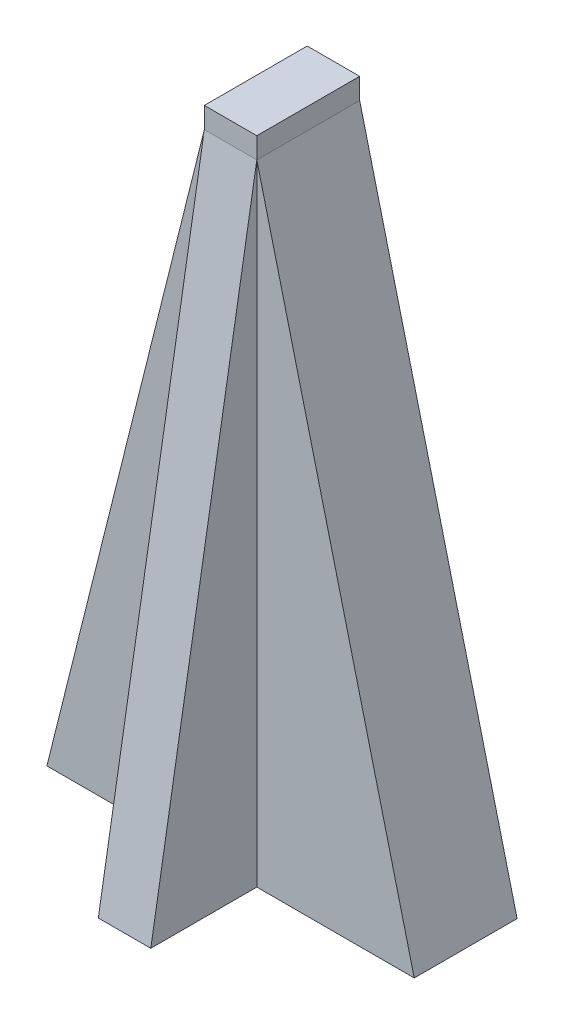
ISO-10303-21;
HEADER;
FILE_DESCRIPTION(('STEP AP214'),'2;1');
FILE_NAME('part.step','',(''),(''),'','','');
FILE_SCHEMA(('AUTOMOTIVE_DESIGN { 1 0 10303 214 1 1 1 1 }'));
ENDSEC;
DATA;
#1=APPLICATION_CONTEXT('core data for automotive mechanical design processes');
#2=APPLICATION_PROTOCOL_DEFINITION('international standard','automotive_design',2000,#1);
#3=PRODUCT_CONTEXT('',#1,'mechanical');
#4=PRODUCT('Part','Part','',(#3));
#5=PRODUCT_RELATED_PRODUCT_CATEGORY('part','',(#4));
#6=PRODUCT_DEFINITION_FORMATION('','',#4);
#7=PRODUCT_DEFINITION_CONTEXT('part definition',#1,'design');
#8=PRODUCT_DEFINITION('design','',#6,#7);
#9=PRODUCT_DEFINITION_SHAPE('','',#8);
#10=(LENGTH_UNIT() NAMED_UNIT(*) SI_UNIT(.MILLI.,.METRE.));
#11=(NAMED_UNIT(*) PLANE_ANGLE_UNIT() SI_UNIT($,.RADIAN.));
#12=(NAMED_UNIT(*) SI_UNIT($,.STERADIAN.) SOLID_ANGLE_UNIT());
#13=UNCERTAINTY_MEASURE_WITH_UNIT(LENGTH_MEASURE(1.E-05),#10,'distance_accuracy_value','');
#14=(GEOMETRIC_REPRESENTATION_CONTEXT(3) GLOBAL_UNCERTAINTY_ASSIGNED_CONTEXT((#13)) GLOBAL_UNIT_ASSIGNED_CONTEXT((#10,
#11,#12)) REPRESENTATION_CONTEXT('',''));
#15=CARTESIAN_POINT('',(0.,0.,0.));
#16=DIRECTION('',(0.,0.,1.));
#17=DIRECTION('',(1.,0.,0.));
#18=AXIS2_PLACEMENT_3D('',#15,#16,#17);
#19=CARTESIAN_POINT('',(6.35,-152.4,0.));
#20=DIRECTION('',(0.,1.,0.));
#21=DIRECTION('',(0.,0.,1.));
#22=AXIS2_PLACEMENT_3D('',#19,#20,#21);
#23=PLANE('',#22);
#24=DIRECTION('',(0.,0.,-1.));
#25=VECTOR('',#24,1.);
#26=CARTESIAN_POINT('',(-6.35,-152.4,0.));
#27=LINE('',#26,#25);
#28=CARTESIAN_POINT('',(-6.35,-152.4,38.1));
#29=VERTEX_POINT('',#28);
#30=CARTESIAN_POINT('',(-6.35,-152.4,12.446));
#31=VERTEX_POINT('',#30);
#32=EDGE_CURVE('E333',#29,#31,#27,.T.);
#33=ORIENTED_EDGE('',*,*,#32,.T.);
#34=DIRECTION('',(-1.,0.,0.));
#35=VECTOR('',#34,1.);
#36=CARTESIAN_POINT('',(-6.35,-152.4,12.446));
#37=LINE('',#36,#35);
#38=CARTESIAN_POINT('',(-44.45,-152.4,12.446));
#39=VERTEX_POINT('',#38);
#40=EDGE_CURVE('E67',#31,#39,#37,.T.);
#41=ORIENTED_EDGE('',*,*,#40,.T.);
#42=DIRECTION('',(0.,0.,-1.));
#43=VECTOR('',#42,1.);
#44=CARTESIAN_POINT('',(-44.45,-152.4,12.446));
#45=LINE('',#44,#43);
#46=CARTESIAN_POINT('',(-44.45,-152.4,-12.446));
#47=VERTEX_POINT('',#46);
#48=EDGE_CURVE('E280',#39,#47,#45,.T.);
#49=ORIENTED_EDGE('',*,*,#48,.T.);
#50=DIRECTION('',(-1.,0.,0.));
#51=VECTOR('',#50,1.);
#52=CARTESIAN_POINT('',(-6.35,-152.4,-12.446));
#53=LINE('',#52,#51);
#54=CARTESIAN_POINT('',(-6.35,-152.4,-12.446));
#55=VERTEX_POINT('',#54);
#56=EDGE_CURVE('E281',#55,#47,#53,.T.);
#57=ORIENTED_EDGE('',*,*,#56,.F.);
#58=CARTESIAN_POINT('',(-6.35,-152.4,-38.1));
#59=VERTEX_POINT('',#58);
#60=EDGE_CURVE('E332',#55,#59,#27,.T.);
#61=ORIENTED_EDGE('',*,*,#60,.T.);
#62=DIRECTION('',(-1.,0.,0.));
#63=VECTOR('',#62,1.);
#64=CARTESIAN_POINT('',(6.35,-152.4,-38.1));
#65=LINE('',#64,#63);
#66=CARTESIAN_POINT('',(6.35,-152.4,-38.1));
#67=VERTEX_POINT('',#66);
#68=EDGE_CURVE('E336',#67,#59,#65,.T.);
#69=ORIENTED_EDGE('',*,*,#68,.F.);
#70=DIRECTION('',(0.,0.,1.));
#71=VECTOR('',#70,1.);
#72=CARTESIAN_POINT('',(6.35,-152.4,0.));
#73=LINE('',#72,#71);
#74=CARTESIAN_POINT('',(6.35000000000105,-152.4,-12.446));
#75=VERTEX_POINT('',#74);
#76=EDGE_CURVE('E316',#67,#75,#73,.T.);
#77=ORIENTED_EDGE('',*,*,#76,.T.);
#78=DIRECTION('',(1.,0.,0.));
#79=VECTOR('',#78,1.);
#80=CARTESIAN_POINT('',(6.35000000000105,-152.4,-12.446));
#81=LINE('',#80,#79);
#82=CARTESIAN_POINT('',(44.450000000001,-152.4,-12.446));
#83=VERTEX_POINT('',#82);
#84=EDGE_CURVE('E285',#75,#83,#81,.T.);
#85=ORIENTED_EDGE('',*,*,#84,.T.);
#86=DIRECTION('',(0.,0.,-1.));
#87=VECTOR('',#86,1.);
#88=CARTESIAN_POINT('',(44.450000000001,-152.4,12.446));
#89=LINE('',#88,#87);
#90=CARTESIAN_POINT('',(44.450000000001,-152.4,12.446));
#91=VERTEX_POINT('',#90);
#92=EDGE_CURVE('E294',#91,#83,#89,.T.);
#93=ORIENTED_EDGE('',*,*,#92,.F.);
#94=DIRECTION('',(1.,0.,0.));
#95=VECTOR('',#94,1.);
#96=CARTESIAN_POINT('',(6.35000000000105,-152.4,12.446));
#97=LINE('',#96,#95);
#98=CARTESIAN_POINT('',(6.35000000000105,-152.4,12.446));
#99=VERTEX_POINT('',#98);
#100=EDGE_CURVE('E306',#99,#91,#97,.T.);
#101=ORIENTED_EDGE('',*,*,#100,.F.);
#102=CARTESIAN_POINT('',(6.35,-152.4,38.1));
#103=VERTEX_POINT('',#102);
#104=EDGE_CURVE('E320',#99,#103,#73,.T.);
#105=ORIENTED_EDGE('',*,*,#104,.T.);
#106=DIRECTION('',(-1.,0.,0.));
#107=VECTOR('',#106,1.);
#108=CARTESIAN_POINT('',(6.35,-152.4,38.1));
#109=LINE('',#108,#107);
#110=EDGE_CURVE('E326',#103,#29,#109,.T.);
#111=ORIENTED_EDGE('',*,*,#110,.T.);
#112=EDGE_LOOP('',(#33,#41,#49,#57,#61,#69,#77,#85,#93,#101,#105,#111));
#113=FACE_BOUND('',#112,.T.);
#114=DIRECTION('',(0.,0.,-1.));
#115=VECTOR('',#114,1.);
#116=CARTESIAN_POINT('',(-1.27,-152.4,0.));
#117=LINE('',#116,#115);
#118=CARTESIAN_POINT('',(-1.27,-152.4,32.9485290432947));
#119=VERTEX_POINT('',#118);
#120=CARTESIAN_POINT('',(-1.27,-152.4,7.366));
#121=VERTEX_POINT('',#120);
#122=EDGE_CURVE('E241',#119,#121,#117,.T.);
#123=ORIENTED_EDGE('',*,*,#122,.F.);
#124=DIRECTION('',(-1.,0.,0.));
#125=VECTOR('',#124,1.);
#126=CARTESIAN_POINT('',(6.35,-152.4,32.9485290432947));
#127=LINE('',#126,#125);
#128=CARTESIAN_POINT('',(1.27,-152.4,32.9485290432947));
#129=VERTEX_POINT('',#128);
#130=EDGE_CURVE('E221',#129,#119,#127,.T.);
#131=ORIENTED_EDGE('',*,*,#130,.F.);
#132=DIRECTION('',(0.,0.,1.));
#133=VECTOR('',#132,1.);
#134=CARTESIAN_POINT('',(1.27,-152.4,0.));
#135=LINE('',#134,#133);
#136=CARTESIAN_POINT('',(1.27,-152.4,7.366));
#137=VERTEX_POINT('',#136);
#138=EDGE_CURVE('E216',#137,#129,#135,.T.);
#139=ORIENTED_EDGE('',*,*,#138,.F.);
#140=DIRECTION('',(1.,0.,0.));
#141=VECTOR('',#140,1.);
#142=CARTESIAN_POINT('',(0.,-152.4,7.366));
#143=LINE('',#142,#141);
#144=CARTESIAN_POINT('',(39.2136558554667,-152.4,7.366));
#145=VERTEX_POINT('',#144);
#146=EDGE_CURVE('E232',#137,#145,#143,.T.);
#147=ORIENTED_EDGE('',*,*,#146,.T.);
#148=DIRECTION('',(0.,0.,-1.));
#149=VECTOR('',#148,1.);
#150=CARTESIAN_POINT('',(39.2136558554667,-152.4,12.446));
#151=LINE('',#150,#149);
#152=CARTESIAN_POINT('',(39.2136558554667,-152.4,-7.366));
#153=VERTEX_POINT('',#152);
#154=EDGE_CURVE('E268',#145,#153,#151,.T.);
#155=ORIENTED_EDGE('',*,*,#154,.T.);
#156=DIRECTION('',(1.,0.,0.));
#157=VECTOR('',#156,1.);
#158=CARTESIAN_POINT('',(0.,-152.4,-7.366));
#159=LINE('',#158,#157);
#160=CARTESIAN_POINT('',(1.27,-152.4,-7.366));
#161=VERTEX_POINT('',#160);
#162=EDGE_CURVE('E260',#161,#153,#159,.T.);
#163=ORIENTED_EDGE('',*,*,#162,.F.);
#164=DIRECTION('',(0.,0.,1.));
#165=VECTOR('',#164,1.);
#166=CARTESIAN_POINT('',(1.27,-152.4,0.));
#167=LINE('',#166,#165);
#168=CARTESIAN_POINT('',(1.27,-152.4,-32.9485290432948));
#169=VERTEX_POINT('',#168);
#170=EDGE_CURVE('E219',#169,#161,#167,.T.);
#171=ORIENTED_EDGE('',*,*,#170,.F.);
#172=DIRECTION('',(-1.,0.,0.));
#173=VECTOR('',#172,1.);
#174=CARTESIAN_POINT('',(6.35,-152.4,-32.9485290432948));
#175=LINE('',#174,#173);
#176=CARTESIAN_POINT('',(-1.27,-152.4,-32.9485290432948));
#177=VERTEX_POINT('',#176);
#178=EDGE_CURVE('E243',#169,#177,#175,.T.);
#179=ORIENTED_EDGE('',*,*,#178,.T.);
#180=DIRECTION('',(0.,0.,-1.));
#181=VECTOR('',#180,1.);
#182=CARTESIAN_POINT('',(-1.27,-152.4,0.));
#183=LINE('',#182,#181);
#184=CARTESIAN_POINT('',(-1.27,-152.4,-7.366));
#185=VERTEX_POINT('',#184);
#186=EDGE_CURVE('E246',#185,#177,#183,.T.);
#187=ORIENTED_EDGE('',*,*,#186,.F.);
#188=DIRECTION('',(-1.,0.,0.));
#189=VECTOR('',#188,1.);
#190=CARTESIAN_POINT('',(0.,-152.4,-7.366));
#191=LINE('',#190,#189);
#192=CARTESIAN_POINT('',(-39.2136558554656,-152.4,-7.366));
#193=VERTEX_POINT('',#192);
#194=EDGE_CURVE('E256',#185,#193,#191,.T.);
#195=ORIENTED_EDGE('',*,*,#194,.T.);
#196=DIRECTION('',(0.,0.,-1.));
#197=VECTOR('',#196,1.);
#198=CARTESIAN_POINT('',(-39.2136558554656,-152.4,12.446));
#199=LINE('',#198,#197);
#200=CARTESIAN_POINT('',(-39.2136558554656,-152.4,7.366));
#201=VERTEX_POINT('',#200);
#202=EDGE_CURVE('E252',#201,#193,#199,.T.);
#203=ORIENTED_EDGE('',*,*,#202,.F.);
#204=DIRECTION('',(-1.,0.,0.));
#205=VECTOR('',#204,1.);
#206=CARTESIAN_POINT('',(0.,-152.4,7.366));
#207=LINE('',#206,#205);
#208=EDGE_CURVE('E247',#121,#201,#207,.T.);
#209=ORIENTED_EDGE('',*,*,#208,.F.);
#210=EDGE_LOOP('',(#123,#131,#139,#147,#155,#163,#171,#179,#187,#195,#203,#209));
#211=FACE_BOUND('',#210,.T.);
#212=ADVANCED_FACE('F44',(#113,#211),#23,.F.);
#213=CARTESIAN_POINT('',(6.35,5.08,12.446));
#214=DIRECTION('',(-1.,0.,0.));
#215=DIRECTION('',(0.,0.,1.));
#216=AXIS2_PLACEMENT_3D('',#213,#214,#215);
#217=PLANE('',#216);
#218=DIRECTION('',(0.,-1.,0.));
#219=VECTOR('',#218,1.);
#220=CARTESIAN_POINT('',(6.35,0.,12.446));
#221=LINE('',#220,#219);
#222=CARTESIAN_POINT('',(6.35,0.,12.446));
#223=VERTEX_POINT('',#222);
#224=EDGE_CURVE('E301',#223,#99,#221,.T.);
#225=ORIENTED_EDGE('',*,*,#224,.F.);
#226=DIRECTION('',(0.,0.986126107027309,-0.16599789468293));
#227=VECTOR('',#226,1.);
#228=CARTESIAN_POINT('',(6.35,-152.4,38.1));
#229=LINE('',#228,#227);
#230=EDGE_CURVE('E319',#103,#223,#229,.T.);
#231=ORIENTED_EDGE('',*,*,#230,.F.);
#232=ORIENTED_EDGE('',*,*,#104,.F.);
#233=EDGE_LOOP('',(#225,#231,#232));
#234=FACE_BOUND('',#233,.T.);
#235=ADVANCED_FACE('F419',(#234),#217,.F.);
#236=DIRECTION('',(0.,0.986126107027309,0.16599789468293));
#237=VECTOR('',#236,1.);
#238=CARTESIAN_POINT('',(6.35,-152.4,-38.1));
#239=LINE('',#238,#237);
#240=CARTESIAN_POINT('',(6.35,0.,-12.446));
#241=VERTEX_POINT('',#240);
#242=EDGE_CURVE('E323',#67,#241,#239,.T.);
#243=ORIENTED_EDGE('',*,*,#242,.T.);
#244=DIRECTION('',(0.,-1.,0.));
#245=VECTOR('',#244,1.);
#246=CARTESIAN_POINT('',(6.35,0.,-12.446));
#247=LINE('',#246,#245);
#248=EDGE_CURVE('E302',#241,#75,#247,.T.);
#249=ORIENTED_EDGE('',*,*,#248,.T.);
#250=ORIENTED_EDGE('',*,*,#76,.F.);
#251=EDGE_LOOP('',(#243,#249,#250));
#252=FACE_BOUND('',#251,.T.);
#253=ADVANCED_FACE('F425',(#252),#217,.F.);
#254=CARTESIAN_POINT('',(-6.35,5.08,12.446));
#255=DIRECTION('',(1.,0.,0.));
#256=DIRECTION('',(0.,0.,-1.));
#257=AXIS2_PLACEMENT_3D('',#254,#255,#256);
#258=PLANE('',#257);
#259=DIRECTION('',(0.,-1.,0.));
#260=VECTOR('',#259,1.);
#261=CARTESIAN_POINT('',(-6.35,0.,-12.446));
#262=LINE('',#261,#260);
#263=CARTESIAN_POINT('',(-6.35,0.,-12.446));
#264=VERTEX_POINT('',#263);
#265=EDGE_CURVE('E276',#264,#55,#262,.T.);
#266=ORIENTED_EDGE('',*,*,#265,.F.);
#267=DIRECTION('',(0.,0.986126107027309,0.16599789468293));
#268=VECTOR('',#267,1.);
#269=CARTESIAN_POINT('',(-6.35,-152.4,-38.1));
#270=LINE('',#269,#268);
#271=EDGE_CURVE('E329',#59,#264,#270,.T.);
#272=ORIENTED_EDGE('',*,*,#271,.F.);
#273=ORIENTED_EDGE('',*,*,#60,.F.);
#274=EDGE_LOOP('',(#266,#272,#273));
#275=FACE_BOUND('',#274,.T.);
#276=ADVANCED_FACE('F381',(#275),#258,.F.);
#277=DIRECTION('',(0.,0.,-1.));
#278=VECTOR('',#277,1.);
#279=CARTESIAN_POINT('',(-6.35,0.,12.446));
#280=LINE('',#279,#278);
#281=CARTESIAN_POINT('',(-6.35,0.,12.446));
#282=VERTEX_POINT('',#281);
#283=EDGE_CURVE('E290',#282,#264,#280,.T.);
#284=ORIENTED_EDGE('',*,*,#283,.F.);
#285=DIRECTION('',(0.,-1.,0.));
#286=VECTOR('',#285,1.);
#287=CARTESIAN_POINT('',(-6.35,5.08,12.446));
#288=LINE('',#287,#286);
#289=CARTESIAN_POINT('',(-6.35,5.08,12.446));
#290=VERTEX_POINT('',#289);
#291=EDGE_CURVE('E359',#290,#282,#288,.T.);
#292=ORIENTED_EDGE('',*,*,#291,.F.);
#293=DIRECTION('',(0.,0.,1.));
#294=VECTOR('',#293,1.);
#295=CARTESIAN_POINT('',(-6.35,5.08,12.446));
#296=LINE('',#295,#294);
#297=CARTESIAN_POINT('',(-6.35,5.08,-12.446));
#298=VERTEX_POINT('',#297);
#299=EDGE_CURVE('E348',#298,#290,#296,.T.);
#300=ORIENTED_EDGE('',*,*,#299,.F.);
#301=DIRECTION('',(0.,-1.,0.));
#302=VECTOR('',#301,1.);
#303=CARTESIAN_POINT('',(-6.35,5.08,-12.446));
#304=LINE('',#303,#302);
#305=EDGE_CURVE('E52',#298,#264,#304,.T.);
#306=ORIENTED_EDGE('',*,*,#305,.T.);
#307=EDGE_LOOP('',(#284,#292,#300,#306));
#308=FACE_BOUND('',#307,.T.);
#309=ADVANCED_FACE('F366',(#308),#258,.F.);
#310=DIRECTION('',(0.,-1.,0.));
#311=VECTOR('',#310,1.);
#312=CARTESIAN_POINT('',(6.35,5.08,12.446));
#313=LINE('',#312,#311);
#314=CARTESIAN_POINT('',(6.35,5.08,12.446));
#315=VERTEX_POINT('',#314);
#316=EDGE_CURVE('E352',#315,#223,#313,.T.);
#317=ORIENTED_EDGE('',*,*,#316,.T.);
#318=DIRECTION('',(0.,0.,-1.));
#319=VECTOR('',#318,1.);
#320=CARTESIAN_POINT('',(6.35,0.,12.446));
#321=LINE('',#320,#319);
#322=EDGE_CURVE('E297',#223,#241,#321,.T.);
#323=ORIENTED_EDGE('',*,*,#322,.T.);
#324=DIRECTION('',(0.,-1.,0.));
#325=VECTOR('',#324,1.);
#326=CARTESIAN_POINT('',(6.35,5.08,-12.446));
#327=LINE('',#326,#325);
#328=CARTESIAN_POINT('',(6.35,5.08,-12.446));
#329=VERTEX_POINT('',#328);
#330=EDGE_CURVE('E11',#329,#241,#327,.T.);
#331=ORIENTED_EDGE('',*,*,#330,.F.);
#332=DIRECTION('',(0.,0.,-1.));
#333=VECTOR('',#332,1.);
#334=CARTESIAN_POINT('',(6.35,5.08,12.446));
#335=LINE('',#334,#333);
#336=EDGE_CURVE('E342',#315,#329,#335,.T.);
#337=ORIENTED_EDGE('',*,*,#336,.F.);
#338=EDGE_LOOP('',(#317,#323,#331,#337));
#339=FACE_BOUND('',#338,.T.);
#340=ADVANCED_FACE('F46',(#339),#217,.F.);
#341=CARTESIAN_POINT('',(-6.35,5.08,-12.446));
#342=DIRECTION('',(0.,0.,1.));
#343=DIRECTION('',(1.,0.,0.));
#344=AXIS2_PLACEMENT_3D('',#341,#342,#343);
#345=PLANE('',#344);
#346=DIRECTION('',(-1.,0.,0.));
#347=VECTOR('',#346,1.);
#348=CARTESIAN_POINT('',(-6.35,0.,-12.446));
#349=LINE('',#348,#347);
#350=EDGE_CURVE('E339',#241,#264,#349,.T.);
#351=ORIENTED_EDGE('',*,*,#350,.T.);
#352=ORIENTED_EDGE('',*,*,#305,.F.);
#353=DIRECTION('',(-1.,0.,0.));
#354=VECTOR('',#353,1.);
#355=CARTESIAN_POINT('',(-6.35,5.08,-12.446));
#356=LINE('',#355,#354);
#357=EDGE_CURVE('E345',#329,#298,#356,.T.);
#358=ORIENTED_EDGE('',*,*,#357,.F.);
#359=ORIENTED_EDGE('',*,*,#330,.T.);
#360=EDGE_LOOP('',(#351,#352,#358,#359));
#361=FACE_BOUND('',#360,.T.);
#362=ADVANCED_FACE('F370',(#361),#345,.F.);
#363=DIRECTION('',(0.,0.986126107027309,-0.16599789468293));
#364=VECTOR('',#363,1.);
#365=CARTESIAN_POINT('',(-6.35,-152.4,38.1));
#366=LINE('',#365,#364);
#367=EDGE_CURVE('E292',#29,#282,#366,.T.);
#368=ORIENTED_EDGE('',*,*,#367,.T.);
#369=DIRECTION('',(0.,-1.,0.));
#370=VECTOR('',#369,1.);
#371=CARTESIAN_POINT('',(-6.35,0.,12.446));
#372=LINE('',#371,#370);
#373=EDGE_CURVE('E278',#282,#31,#372,.T.);
#374=ORIENTED_EDGE('',*,*,#373,.T.);
#375=ORIENTED_EDGE('',*,*,#32,.F.);
#376=EDGE_LOOP('',(#368,#374,#375));
#377=FACE_BOUND('',#376,.T.);
#378=ADVANCED_FACE('F389',(#377),#258,.F.);
#379=CARTESIAN_POINT('',(-6.35,5.08,12.446));
#380=DIRECTION('',(0.,0.,-1.));
#381=DIRECTION('',(-1.,0.,0.));
#382=AXIS2_PLACEMENT_3D('',#379,#380,#381);
#383=PLANE('',#382);
#384=DIRECTION('',(1.,0.,0.));
#385=VECTOR('',#384,1.);
#386=CARTESIAN_POINT('',(-6.35,0.,12.446));
#387=LINE('',#386,#385);
#388=EDGE_CURVE('E346',#282,#223,#387,.T.);
#389=ORIENTED_EDGE('',*,*,#388,.T.);
#390=ORIENTED_EDGE('',*,*,#316,.F.);
#391=DIRECTION('',(1.,0.,0.));
#392=VECTOR('',#391,1.);
#393=CARTESIAN_POINT('',(-6.35,5.08,12.446));
#394=LINE('',#393,#392);
#395=EDGE_CURVE('E350',#290,#315,#394,.T.);
#396=ORIENTED_EDGE('',*,*,#395,.F.);
#397=ORIENTED_EDGE('',*,*,#291,.T.);
#398=EDGE_LOOP('',(#389,#390,#396,#397));
#399=FACE_BOUND('',#398,.T.);
#400=ADVANCED_FACE('F401',(#399),#383,.F.);
#401=CARTESIAN_POINT('',(0.,5.08,0.));
#402=DIRECTION('',(0.,-1.,0.));
#403=DIRECTION('',(0.,0.,-1.));
#404=AXIS2_PLACEMENT_3D('',#401,#402,#403);
#405=PLANE('',#404);
#406=ORIENTED_EDGE('',*,*,#336,.T.);
#407=ORIENTED_EDGE('',*,*,#357,.T.);
#408=ORIENTED_EDGE('',*,*,#299,.T.);
#409=ORIENTED_EDGE('',*,*,#395,.T.);
#410=EDGE_LOOP('',(#406,#407,#408,#409));
#411=FACE_BOUND('',#410,.T.);
#412=ADVANCED_FACE('F407',(#411),#405,.F.);
#413=CARTESIAN_POINT('',(6.35,-152.4,-38.1));
#414=DIRECTION('',(0.,-0.16599789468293,0.986126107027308));
#415=DIRECTION('',(0.,-0.986126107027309,-0.16599789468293));
#416=AXIS2_PLACEMENT_3D('',#413,#414,#415);
#417=PLANE('',#416);
#418=ORIENTED_EDGE('',*,*,#271,.T.);
#419=ORIENTED_EDGE('',*,*,#350,.F.);
#420=ORIENTED_EDGE('',*,*,#242,.F.);
#421=ORIENTED_EDGE('',*,*,#68,.T.);
#422=EDGE_LOOP('',(#418,#419,#420,#421));
#423=FACE_BOUND('',#422,.T.);
#424=ADVANCED_FACE('F375',(#423),#417,.F.);
#425=CARTESIAN_POINT('',(6.35,-152.4,38.1));
#426=DIRECTION('',(0.,0.16599789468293,0.986126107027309));
#427=DIRECTION('',(0.,-0.986126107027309,0.16599789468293));
#428=AXIS2_PLACEMENT_3D('',#425,#426,#427);
#429=PLANE('',#428);
#430=ORIENTED_EDGE('',*,*,#367,.F.);
#431=ORIENTED_EDGE('',*,*,#110,.F.);
#432=ORIENTED_EDGE('',*,*,#230,.T.);
#433=ORIENTED_EDGE('',*,*,#388,.F.);
#434=EDGE_LOOP('',(#430,#431,#432,#433));
#435=FACE_BOUND('',#434,.T.);
#436=ADVANCED_FACE('F398',(#435),#429,.T.);
#437=CARTESIAN_POINT('',(-44.45,-152.4,12.446));
#438=DIRECTION('',(-0.970142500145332,0.242535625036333,0.));
#439=DIRECTION('',(-0.242535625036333,-0.970142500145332,0.));
#440=AXIS2_PLACEMENT_3D('',#437,#438,#439);
#441=PLANE('',#440);
#442=DIRECTION('',(0.242535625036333,0.970142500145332,0.));
#443=VECTOR('',#442,1.);
#444=CARTESIAN_POINT('',(-44.45,-152.4,-12.446));
#445=LINE('',#444,#443);
#446=EDGE_CURVE('E284',#47,#264,#445,.T.);
#447=ORIENTED_EDGE('',*,*,#446,.F.);
#448=ORIENTED_EDGE('',*,*,#48,.F.);
#449=DIRECTION('',(0.242535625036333,0.970142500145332,0.));
#450=VECTOR('',#449,1.);
#451=CARTESIAN_POINT('',(-44.45,-152.4,12.446));
#452=LINE('',#451,#450);
#453=EDGE_CURVE('E275',#39,#282,#452,.T.);
#454=ORIENTED_EDGE('',*,*,#453,.T.);
#455=ORIENTED_EDGE('',*,*,#283,.T.);
#456=EDGE_LOOP('',(#447,#448,#454,#455));
#457=FACE_BOUND('',#456,.T.);
#458=ADVANCED_FACE('F386',(#457),#441,.T.);
#459=CARTESIAN_POINT('',(0.,0.,12.446));
#460=DIRECTION('',(0.,0.,1.));
#461=DIRECTION('',(1.,0.,0.));
#462=AXIS2_PLACEMENT_3D('',#459,#460,#461);
#463=PLANE('',#462);
#464=ORIENTED_EDGE('',*,*,#40,.F.);
#465=ORIENTED_EDGE('',*,*,#373,.F.);
#466=ORIENTED_EDGE('',*,*,#453,.F.);
#467=EDGE_LOOP('',(#464,#465,#466));
#468=FACE_BOUND('',#467,.T.);
#469=ADVANCED_FACE('F387',(#468),#463,.T.);
#470=CARTESIAN_POINT('',(0.,0.,-12.446));
#471=DIRECTION('',(0.,0.,1.));
#472=DIRECTION('',(1.,0.,0.));
#473=AXIS2_PLACEMENT_3D('',#470,#471,#472);
#474=PLANE('',#473);
#475=ORIENTED_EDGE('',*,*,#56,.T.);
#476=ORIENTED_EDGE('',*,*,#446,.T.);
#477=ORIENTED_EDGE('',*,*,#265,.T.);
#478=EDGE_LOOP('',(#475,#476,#477));
#479=FACE_BOUND('',#478,.T.);
#480=ADVANCED_FACE('F383',(#479),#474,.F.);
#481=CARTESIAN_POINT('',(44.450000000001,-152.4,12.446));
#482=DIRECTION('',(-0.97014250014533,-0.24253562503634,0.));
#483=DIRECTION('',(0.24253562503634,-0.97014250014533,0.));
#484=AXIS2_PLACEMENT_3D('',#481,#482,#483);
#485=PLANE('',#484);
#486=DIRECTION('',(-0.24253562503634,0.97014250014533,0.));
#487=VECTOR('',#486,1.);
#488=CARTESIAN_POINT('',(44.450000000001,-152.4,-12.446));
#489=LINE('',#488,#487);
#490=EDGE_CURVE('E305',#83,#241,#489,.T.);
#491=ORIENTED_EDGE('',*,*,#490,.T.);
#492=ORIENTED_EDGE('',*,*,#322,.F.);
#493=DIRECTION('',(-0.24253562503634,0.97014250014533,0.));
#494=VECTOR('',#493,1.);
#495=CARTESIAN_POINT('',(44.450000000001,-152.4,12.446));
#496=LINE('',#495,#494);
#497=EDGE_CURVE('E312',#91,#223,#496,.T.);
#498=ORIENTED_EDGE('',*,*,#497,.F.);
#499=ORIENTED_EDGE('',*,*,#92,.T.);
#500=EDGE_LOOP('',(#491,#492,#498,#499));
#501=FACE_BOUND('',#500,.T.);
#502=ADVANCED_FACE('F441',(#501),#485,.F.);
#503=CARTESIAN_POINT('',(0.,0.,12.446));
#504=DIRECTION('',(0.,0.,-1.));
#505=DIRECTION('',(-1.,0.,0.));
#506=AXIS2_PLACEMENT_3D('',#503,#504,#505);
#507=PLANE('',#506);
#508=ORIENTED_EDGE('',*,*,#100,.T.);
#509=ORIENTED_EDGE('',*,*,#497,.T.);
#510=ORIENTED_EDGE('',*,*,#224,.T.);
#511=EDGE_LOOP('',(#508,#509,#510));
#512=FACE_BOUND('',#511,.T.);
#513=ADVANCED_FACE('F428',(#512),#507,.F.);
#514=CARTESIAN_POINT('',(0.,0.,-12.446));
#515=DIRECTION('',(0.,0.,-1.));
#516=DIRECTION('',(-1.,0.,0.));
#517=AXIS2_PLACEMENT_3D('',#514,#515,#516);
#518=PLANE('',#517);
#519=ORIENTED_EDGE('',*,*,#84,.F.);
#520=ORIENTED_EDGE('',*,*,#248,.F.);
#521=ORIENTED_EDGE('',*,*,#490,.F.);
#522=EDGE_LOOP('',(#519,#520,#521));
#523=FACE_BOUND('',#522,.T.);
#524=ADVANCED_FACE('F444',(#523),#518,.T.);
#525=CARTESIAN_POINT('',(1.27,5.08,12.446));
#526=DIRECTION('',(-1.,0.,0.));
#527=DIRECTION('',(0.,0.,1.));
#528=AXIS2_PLACEMENT_3D('',#525,#526,#527);
#529=PLANE('',#528);
#530=DIRECTION('',(0.,-1.,0.));
#531=VECTOR('',#530,1.);
#532=CARTESIAN_POINT('',(1.27,5.08,7.366));
#533=LINE('',#532,#531);
#534=CARTESIAN_POINT('',(1.27,0.,7.366));
#535=VERTEX_POINT('',#534);
#536=CARTESIAN_POINT('',(1.27,-0.424579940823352,7.366));
#537=VERTEX_POINT('',#536);
#538=EDGE_CURVE('E196',#535,#537,#533,.T.);
#539=ORIENTED_EDGE('',*,*,#538,.F.);
#540=DIRECTION('',(0.,0.,-1.));
#541=VECTOR('',#540,1.);
#542=CARTESIAN_POINT('',(1.27,0.,0.));
#543=LINE('',#542,#541);
#544=CARTESIAN_POINT('',(1.27,0.,-7.366));
#545=VERTEX_POINT('',#544);
#546=EDGE_CURVE('E211',#535,#545,#543,.T.);
#547=ORIENTED_EDGE('',*,*,#546,.T.);
#548=DIRECTION('',(0.,-1.,0.));
#549=VECTOR('',#548,1.);
#550=CARTESIAN_POINT('',(1.27,5.08,-7.366));
#551=LINE('',#550,#549);
#552=CARTESIAN_POINT('',(1.27,-0.424579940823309,-7.366));
#553=VERTEX_POINT('',#552);
#554=EDGE_CURVE('E298',#545,#553,#551,.T.);
#555=ORIENTED_EDGE('',*,*,#554,.T.);
#556=DIRECTION('',(0.,0.986126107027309,0.16599789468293));
#557=VECTOR('',#556,1.);
#558=CARTESIAN_POINT('',(1.27,8.17144216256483,-5.91900294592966));
#559=LINE('',#558,#557);
#560=EDGE_CURVE('E218',#169,#553,#559,.T.);
#561=ORIENTED_EDGE('',*,*,#560,.F.);
#562=ORIENTED_EDGE('',*,*,#170,.T.);
#563=DIRECTION('',(0.,-1.,0.));
#564=VECTOR('',#563,1.);
#565=CARTESIAN_POINT('',(1.27,5.08,-7.366));
#566=LINE('',#565,#564);
#567=CARTESIAN_POINT('',(1.27,-0.625376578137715,-7.366));
#568=VERTEX_POINT('',#567);
#569=EDGE_CURVE('E273',#568,#161,#566,.T.);
#570=ORIENTED_EDGE('',*,*,#569,.F.);
#571=DIRECTION('',(0.,0.,-1.));
#572=VECTOR('',#571,1.);
#573=CARTESIAN_POINT('',(1.27,-0.625376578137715,12.446));
#574=LINE('',#573,#572);
#575=CARTESIAN_POINT('',(1.27,-0.62537657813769,7.366));
#576=VERTEX_POINT('',#575);
#577=EDGE_CURVE('E237',#576,#568,#574,.T.);
#578=ORIENTED_EDGE('',*,*,#577,.F.);
#579=DIRECTION('',(0.,-1.,0.));
#580=VECTOR('',#579,1.);
#581=CARTESIAN_POINT('',(1.27,5.08,7.366));
#582=LINE('',#581,#580);
#583=EDGE_CURVE('E233',#576,#137,#582,.T.);
#584=ORIENTED_EDGE('',*,*,#583,.T.);
#585=ORIENTED_EDGE('',*,*,#138,.T.);
#586=DIRECTION('',(0.,0.986126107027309,-0.16599789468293));
#587=VECTOR('',#586,1.);
#588=CARTESIAN_POINT('',(1.27,4.09674976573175,6.60490949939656));
#589=LINE('',#588,#587);
#590=EDGE_CURVE('E59',#129,#537,#589,.T.);
#591=ORIENTED_EDGE('',*,*,#590,.T.);
#592=EDGE_LOOP('',(#539,#547,#555,#561,#562,#570,#578,#584,#585,#591));
#593=FACE_BOUND('',#592,.T.);
#594=ADVANCED_FACE('F214',(#593),#529,.T.);
#595=CARTESIAN_POINT('',(-6.35,5.08,-7.366));
#596=DIRECTION('',(0.,0.,1.));
#597=DIRECTION('',(1.,0.,0.));
#598=AXIS2_PLACEMENT_3D('',#595,#596,#597);
#599=PLANE('',#598);
#600=DIRECTION('',(-1.,0.,0.));
#601=VECTOR('',#600,1.);
#602=CARTESIAN_POINT('',(6.35,-0.424579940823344,-7.366));
#603=LINE('',#602,#601);
#604=CARTESIAN_POINT('',(-1.27,-0.424579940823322,-7.366));
#605=VERTEX_POINT('',#604);
#606=EDGE_CURVE('E212',#553,#605,#603,.T.);
#607=ORIENTED_EDGE('',*,*,#606,.F.);
#608=ORIENTED_EDGE('',*,*,#554,.F.);
#609=DIRECTION('',(-1.,0.,0.));
#610=VECTOR('',#609,1.);
#611=CARTESIAN_POINT('',(0.,0.,-7.366));
#612=LINE('',#611,#610);
#613=CARTESIAN_POINT('',(-1.27,0.,-7.366));
#614=VERTEX_POINT('',#613);
#615=EDGE_CURVE('E759',#545,#614,#612,.T.);
#616=ORIENTED_EDGE('',*,*,#615,.T.);
#617=DIRECTION('',(0.,-1.,0.));
#618=VECTOR('',#617,1.);
#619=CARTESIAN_POINT('',(-1.27,5.08,-7.366));
#620=LINE('',#619,#618);
#621=EDGE_CURVE('E717',#614,#605,#620,.T.);
#622=ORIENTED_EDGE('',*,*,#621,.T.);
#623=EDGE_LOOP('',(#607,#608,#616,#622));
#624=FACE_BOUND('',#623,.T.);
#625=ADVANCED_FACE('F449',(#624),#599,.T.);
#626=CARTESIAN_POINT('',(-1.27,5.08,12.446));
#627=DIRECTION('',(1.,0.,0.));
#628=DIRECTION('',(0.,0.,-1.));
#629=AXIS2_PLACEMENT_3D('',#626,#627,#628);
#630=PLANE('',#629);
#631=DIRECTION('',(0.,0.986126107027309,-0.16599789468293));
#632=VECTOR('',#631,1.);
#633=CARTESIAN_POINT('',(-1.27,-153.243269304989,33.0904793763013));
#634=LINE('',#633,#632);
#635=CARTESIAN_POINT('',(-1.27,-0.424579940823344,7.366));
#636=VERTEX_POINT('',#635);
#637=EDGE_CURVE('E210',#119,#636,#634,.T.);
#638=ORIENTED_EDGE('',*,*,#637,.F.);
#639=ORIENTED_EDGE('',*,*,#122,.T.);
#640=DIRECTION('',(0.,-1.,0.));
#641=VECTOR('',#640,1.);
#642=CARTESIAN_POINT('',(-1.27,5.08,7.366));
#643=LINE('',#642,#641);
#644=CARTESIAN_POINT('',(-1.26999999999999,-0.625376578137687,7.366));
#645=VERTEX_POINT('',#644);
#646=EDGE_CURVE('E255',#645,#121,#643,.T.);
#647=ORIENTED_EDGE('',*,*,#646,.F.);
#648=DIRECTION('',(0.,0.,-1.));
#649=VECTOR('',#648,1.);
#650=CARTESIAN_POINT('',(-1.26999999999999,-0.625376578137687,12.446));
#651=LINE('',#650,#649);
#652=CARTESIAN_POINT('',(-1.27,-0.625376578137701,-7.366));
#653=VERTEX_POINT('',#652);
#654=EDGE_CURVE('E254',#645,#653,#651,.T.);
#655=ORIENTED_EDGE('',*,*,#654,.T.);
#656=DIRECTION('',(0.,-1.,0.));
#657=VECTOR('',#656,1.);
#658=CARTESIAN_POINT('',(-1.27,5.08,-7.366));
#659=LINE('',#658,#657);
#660=EDGE_CURVE('E251',#653,#185,#659,.T.);
#661=ORIENTED_EDGE('',*,*,#660,.T.);
#662=ORIENTED_EDGE('',*,*,#186,.T.);
#663=DIRECTION('',(0.,0.986126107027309,0.16599789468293));
#664=VECTOR('',#663,1.);
#665=CARTESIAN_POINT('',(-1.27,-153.243269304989,-33.0904793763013));
#666=LINE('',#665,#664);
#667=EDGE_CURVE('E262',#177,#605,#666,.T.);
#668=ORIENTED_EDGE('',*,*,#667,.T.);
#669=ORIENTED_EDGE('',*,*,#621,.F.);
#670=DIRECTION('',(0.,0.,1.));
#671=VECTOR('',#670,1.);
#672=CARTESIAN_POINT('',(-1.27,0.,0.));
#673=LINE('',#672,#671);
#674=CARTESIAN_POINT('',(-1.27,0.,7.366));
#675=VERTEX_POINT('',#674);
#676=EDGE_CURVE('E757',#614,#675,#673,.T.);
#677=ORIENTED_EDGE('',*,*,#676,.T.);
#678=DIRECTION('',(0.,-1.,0.));
#679=VECTOR('',#678,1.);
#680=CARTESIAN_POINT('',(-1.27,5.08,7.366));
#681=LINE('',#680,#679);
#682=EDGE_CURVE('E206',#675,#636,#681,.T.);
#683=ORIENTED_EDGE('',*,*,#682,.T.);
#684=EDGE_LOOP('',(#638,#639,#647,#655,#661,#662,#668,#669,#677,#683));
#685=FACE_BOUND('',#684,.T.);
#686=ADVANCED_FACE('F583',(#685),#630,.T.);
#687=CARTESIAN_POINT('',(-6.35,5.08,7.366));
#688=DIRECTION('',(0.,0.,-1.));
#689=DIRECTION('',(-1.,0.,0.));
#690=AXIS2_PLACEMENT_3D('',#687,#688,#689);
#691=PLANE('',#690);
#692=DIRECTION('',(1.,0.,0.));
#693=VECTOR('',#692,1.);
#694=CARTESIAN_POINT('',(-6.35,-0.424579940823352,7.366));
#695=LINE('',#694,#693);
#696=EDGE_CURVE('E199',#636,#537,#695,.T.);
#697=ORIENTED_EDGE('',*,*,#696,.F.);
#698=ORIENTED_EDGE('',*,*,#682,.F.);
#699=DIRECTION('',(1.,0.,0.));
#700=VECTOR('',#699,1.);
#701=CARTESIAN_POINT('',(0.,0.,7.366));
#702=LINE('',#701,#700);
#703=EDGE_CURVE('E202',#675,#535,#702,.T.);
#704=ORIENTED_EDGE('',*,*,#703,.T.);
#705=ORIENTED_EDGE('',*,*,#538,.T.);
#706=EDGE_LOOP('',(#697,#698,#704,#705));
#707=FACE_BOUND('',#706,.T.);
#708=ADVANCED_FACE('F197',(#707),#691,.T.);
#709=CARTESIAN_POINT('',(0.,0.,0.));
#710=DIRECTION('',(0.,-1.,0.));
#711=DIRECTION('',(0.,0.,-1.));
#712=AXIS2_PLACEMENT_3D('',#709,#710,#711);
#713=PLANE('',#712);
#714=ORIENTED_EDGE('',*,*,#546,.F.);
#715=ORIENTED_EDGE('',*,*,#703,.F.);
#716=ORIENTED_EDGE('',*,*,#676,.F.);
#717=ORIENTED_EDGE('',*,*,#615,.F.);
#718=EDGE_LOOP('',(#714,#715,#716,#717));
#719=FACE_BOUND('',#718,.T.);
#720=ADVANCED_FACE('F605',(#719),#713,.T.);
#721=CARTESIAN_POINT('',(6.35,-153.243269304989,-33.0904793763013));
#722=DIRECTION('',(0.,-0.16599789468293,0.986126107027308));
#723=DIRECTION('',(0.,-0.986126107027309,-0.16599789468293));
#724=AXIS2_PLACEMENT_3D('',#721,#722,#723);
#725=PLANE('',#724);
#726=ORIENTED_EDGE('',*,*,#667,.F.);
#727=ORIENTED_EDGE('',*,*,#178,.F.);
#728=ORIENTED_EDGE('',*,*,#560,.T.);
#729=ORIENTED_EDGE('',*,*,#606,.T.);
#730=EDGE_LOOP('',(#726,#727,#728,#729));
#731=FACE_BOUND('',#730,.T.);
#732=ADVANCED_FACE('F614',(#731),#725,.T.);
#733=CARTESIAN_POINT('',(6.35,-153.243269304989,33.0904793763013));
#734=DIRECTION('',(0.,0.16599789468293,0.986126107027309));
#735=DIRECTION('',(0.,-0.986126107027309,0.16599789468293));
#736=AXIS2_PLACEMENT_3D('',#733,#734,#735);
#737=PLANE('',#736);
#738=ORIENTED_EDGE('',*,*,#637,.T.);
#739=ORIENTED_EDGE('',*,*,#696,.T.);
#740=ORIENTED_EDGE('',*,*,#590,.F.);
#741=ORIENTED_EDGE('',*,*,#130,.T.);
#742=EDGE_LOOP('',(#738,#739,#740,#741));
#743=FACE_BOUND('',#742,.T.);
#744=ADVANCED_FACE('F208',(#743),#737,.F.);
#745=CARTESIAN_POINT('',(-39.5216760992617,-153.632080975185,12.446));
#746=DIRECTION('',(-0.970142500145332,0.242535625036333,0.));
#747=DIRECTION('',(-0.242535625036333,-0.970142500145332,0.));
#748=AXIS2_PLACEMENT_3D('',#745,#746,#747);
#749=PLANE('',#748);
#750=DIRECTION('',(0.242535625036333,0.970142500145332,0.));
#751=VECTOR('',#750,1.);
#752=CARTESIAN_POINT('',(-39.5216760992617,-153.632080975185,-7.366));
#753=LINE('',#752,#751);
#754=EDGE_CURVE('E259',#193,#653,#753,.T.);
#755=ORIENTED_EDGE('',*,*,#754,.T.);
#756=ORIENTED_EDGE('',*,*,#654,.F.);
#757=DIRECTION('',(0.242535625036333,0.970142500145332,0.));
#758=VECTOR('',#757,1.);
#759=CARTESIAN_POINT('',(-39.5216760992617,-153.632080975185,7.366));
#760=LINE('',#759,#758);
#761=EDGE_CURVE('E250',#201,#645,#760,.T.);
#762=ORIENTED_EDGE('',*,*,#761,.F.);
#763=ORIENTED_EDGE('',*,*,#202,.T.);
#764=EDGE_LOOP('',(#755,#756,#762,#763));
#765=FACE_BOUND('',#764,.T.);
#766=ADVANCED_FACE('F633',(#765),#749,.F.);
#767=CARTESIAN_POINT('',(0.,0.,7.366));
#768=DIRECTION('',(0.,0.,1.));
#769=DIRECTION('',(1.,0.,0.));
#770=AXIS2_PLACEMENT_3D('',#767,#768,#769);
#771=PLANE('',#770);
#772=ORIENTED_EDGE('',*,*,#208,.T.);
#773=ORIENTED_EDGE('',*,*,#761,.T.);
#774=ORIENTED_EDGE('',*,*,#646,.T.);
#775=EDGE_LOOP('',(#772,#773,#774));
#776=FACE_BOUND('',#775,.T.);
#777=ADVANCED_FACE('F642',(#776),#771,.F.);
#778=CARTESIAN_POINT('',(0.,0.,-7.366));
#779=DIRECTION('',(0.,0.,1.));
#780=DIRECTION('',(1.,0.,0.));
#781=AXIS2_PLACEMENT_3D('',#778,#779,#780);
#782=PLANE('',#781);
#783=ORIENTED_EDGE('',*,*,#194,.F.);
#784=ORIENTED_EDGE('',*,*,#660,.F.);
#785=ORIENTED_EDGE('',*,*,#754,.F.);
#786=EDGE_LOOP('',(#783,#784,#785));
#787=FACE_BOUND('',#786,.T.);
#788=ADVANCED_FACE('F652',(#787),#782,.T.);
#789=CARTESIAN_POINT('',(39.5216760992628,-153.632080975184,12.446));
#790=DIRECTION('',(-0.97014250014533,-0.24253562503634,0.));
#791=DIRECTION('',(0.24253562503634,-0.97014250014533,0.));
#792=AXIS2_PLACEMENT_3D('',#789,#790,#791);
#793=PLANE('',#792);
#794=DIRECTION('',(-0.24253562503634,0.97014250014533,0.));
#795=VECTOR('',#794,1.);
#796=CARTESIAN_POINT('',(1.048146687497,0.262036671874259,-7.366));
#797=LINE('',#796,#795);
#798=EDGE_CURVE('E267',#153,#568,#797,.T.);
#799=ORIENTED_EDGE('',*,*,#798,.F.);
#800=ORIENTED_EDGE('',*,*,#154,.F.);
#801=DIRECTION('',(-0.24253562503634,0.97014250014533,0.));
#802=VECTOR('',#801,1.);
#803=CARTESIAN_POINT('',(1.048146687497,0.262036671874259,7.366));
#804=LINE('',#803,#802);
#805=EDGE_CURVE('E230',#145,#576,#804,.T.);
#806=ORIENTED_EDGE('',*,*,#805,.T.);
#807=ORIENTED_EDGE('',*,*,#577,.T.);
#808=EDGE_LOOP('',(#799,#800,#806,#807));
#809=FACE_BOUND('',#808,.T.);
#810=ADVANCED_FACE('F662',(#809),#793,.T.);
#811=CARTESIAN_POINT('',(0.,0.,7.366));
#812=DIRECTION('',(0.,0.,-1.));
#813=DIRECTION('',(-1.,0.,0.));
#814=AXIS2_PLACEMENT_3D('',#811,#812,#813);
#815=PLANE('',#814);
#816=ORIENTED_EDGE('',*,*,#146,.F.);
#817=ORIENTED_EDGE('',*,*,#583,.F.);
#818=ORIENTED_EDGE('',*,*,#805,.F.);
#819=EDGE_LOOP('',(#816,#817,#818));
#820=FACE_BOUND('',#819,.T.);
#821=ADVANCED_FACE('F672',(#820),#815,.T.);
#822=CARTESIAN_POINT('',(0.,0.,-7.366));
#823=DIRECTION('',(0.,0.,-1.));
#824=DIRECTION('',(-1.,0.,0.));
#825=AXIS2_PLACEMENT_3D('',#822,#823,#824);
#826=PLANE('',#825);
#827=ORIENTED_EDGE('',*,*,#162,.T.);
#828=ORIENTED_EDGE('',*,*,#798,.T.);
#829=ORIENTED_EDGE('',*,*,#569,.T.);
#830=EDGE_LOOP('',(#827,#828,#829));
#831=FACE_BOUND('',#830,.T.);
#832=ADVANCED_FACE('F682',(#831),#826,.F.);
#833=CLOSED_SHELL('',(#212,#235,#253,#276,#309,#340,#362,#378,#400,#412,#424,#436,#458,#469,
#480,#502,#513,#524,#594,#625,#686,#708,#720,#732,#744,#766,#777,#788,#810,#821,#832));
#834=MANIFOLD_SOLID_BREP('B2',#833);
#835=ADVANCED_BREP_SHAPE_REPRESENTATION('',(#18,#834),#14);
#836=SHAPE_DEFINITION_REPRESENTATION(#9,#835);
ENDSEC;
END-ISO-10303-21;
